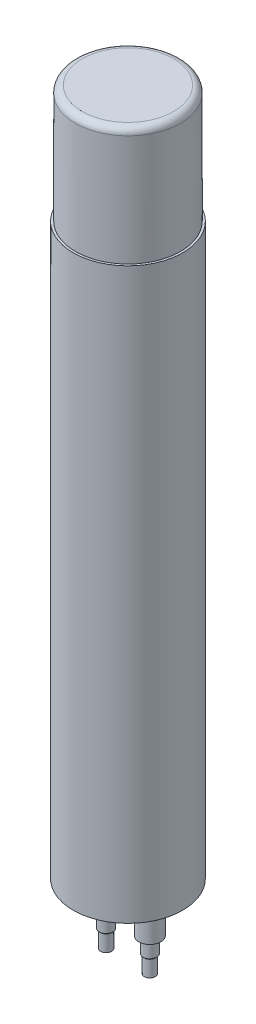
ISO-10303-21;
HEADER;
FILE_DESCRIPTION(('STEP AP214'),'2;1');
FILE_NAME('part.step','',(''),(''),'','','');
FILE_SCHEMA(('AUTOMOTIVE_DESIGN { 1 0 10303 214 1 1 1 1 }'));
ENDSEC;
DATA;
#1=APPLICATION_CONTEXT('core data for automotive mechanical design processes');
#2=APPLICATION_PROTOCOL_DEFINITION('international standard','automotive_design',2000,#1);
#3=PRODUCT_CONTEXT('',#1,'mechanical');
#4=PRODUCT('Part','Part','',(#3));
#5=PRODUCT_RELATED_PRODUCT_CATEGORY('part','',(#4));
#6=PRODUCT_DEFINITION_FORMATION('','',#4);
#7=PRODUCT_DEFINITION_CONTEXT('part definition',#1,'design');
#8=PRODUCT_DEFINITION('design','',#6,#7);
#9=PRODUCT_DEFINITION_SHAPE('','',#8);
#10=(LENGTH_UNIT() NAMED_UNIT(*) SI_UNIT(.MILLI.,.METRE.));
#11=(NAMED_UNIT(*) PLANE_ANGLE_UNIT() SI_UNIT($,.RADIAN.));
#12=(NAMED_UNIT(*) SI_UNIT($,.STERADIAN.) SOLID_ANGLE_UNIT());
#13=UNCERTAINTY_MEASURE_WITH_UNIT(LENGTH_MEASURE(1.E-05),#10,'distance_accuracy_value','');
#14=(GEOMETRIC_REPRESENTATION_CONTEXT(3) GLOBAL_UNCERTAINTY_ASSIGNED_CONTEXT((#13)) GLOBAL_UNIT_ASSIGNED_CONTEXT((#10,
#11,#12)) REPRESENTATION_CONTEXT('',''));
#15=CARTESIAN_POINT('',(0.,0.,0.));
#16=DIRECTION('',(0.,0.,1.));
#17=DIRECTION('',(1.,0.,0.));
#18=AXIS2_PLACEMENT_3D('',#15,#16,#17);
#19=CARTESIAN_POINT('',(63.5000000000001,-797.052,0.));
#20=DIRECTION('',(0.,1.,0.));
#21=DIRECTION('',(-1.,0.,0.));
#22=AXIS2_PLACEMENT_3D('',#19,#20,#21);
#23=PLANE('',#22);
#24=CARTESIAN_POINT('',(-25.4000000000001,-797.052,0.));
#25=DIRECTION('',(0.,1.,0.));
#26=DIRECTION('',(-1.,0.,0.));
#27=AXIS2_PLACEMENT_3D('',#24,#25,#26);
#28=CIRCLE('',#27,12.7);
#29=CARTESIAN_POINT('',(-38.1000000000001,-797.052,0.));
#30=VERTEX_POINT('',#29);
#31=EDGE_CURVE('E78',#30,#30,#28,.T.);
#32=ORIENTED_EDGE('',*,*,#31,.T.);
#33=EDGE_LOOP('',(#32));
#34=FACE_BOUND('',#33,.T.);
#35=CARTESIAN_POINT('',(0.,-797.052,0.));
#36=DIRECTION('',(0.,1.,0.));
#37=DIRECTION('',(-1.,0.,0.));
#38=AXIS2_PLACEMENT_3D('',#35,#36,#37);
#39=CIRCLE('',#38,63.5);
#40=CARTESIAN_POINT('',(-63.4999999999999,-797.052,0.));
#41=VERTEX_POINT('',#40);
#42=EDGE_CURVE('E54',#41,#41,#39,.T.);
#43=ORIENTED_EDGE('',*,*,#42,.F.);
#44=EDGE_LOOP('',(#43));
#45=FACE_BOUND('',#44,.T.);
#46=CARTESIAN_POINT('',(25.4000000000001,-797.052,0.));
#47=DIRECTION('',(0.,1.,0.));
#48=DIRECTION('',(-1.,0.,0.));
#49=AXIS2_PLACEMENT_3D('',#46,#47,#48);
#50=CIRCLE('',#49,12.7);
#51=CARTESIAN_POINT('',(12.7000000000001,-797.052,0.));
#52=VERTEX_POINT('',#51);
#53=EDGE_CURVE('E42',#52,#52,#50,.F.);
#54=ORIENTED_EDGE('',*,*,#53,.F.);
#55=EDGE_LOOP('',(#54));
#56=FACE_BOUND('',#55,.T.);
#57=ADVANCED_FACE('F32',(#34,#45,#56),#23,.F.);
#58=CARTESIAN_POINT('',(0.,0.,0.));
#59=DIRECTION('',(0.,1.,0.));
#60=DIRECTION('',(-1.,0.,0.));
#61=AXIS2_PLACEMENT_3D('',#58,#59,#60);
#62=CYLINDRICAL_SURFACE('',#61,63.5);
#63=CARTESIAN_POINT('',(0.,-136.652,0.));
#64=DIRECTION('',(0.,1.,0.));
#65=DIRECTION('',(-1.,0.,0.));
#66=AXIS2_PLACEMENT_3D('',#63,#64,#65);
#67=CIRCLE('',#66,63.5);
#68=CARTESIAN_POINT('',(-63.5,-136.652,0.));
#69=VERTEX_POINT('',#68);
#70=EDGE_CURVE('E57',#69,#69,#67,.T.);
#71=ORIENTED_EDGE('',*,*,#70,.F.);
#72=EDGE_LOOP('',(#71));
#73=FACE_BOUND('',#72,.T.);
#74=ORIENTED_EDGE('',*,*,#42,.T.);
#75=EDGE_LOOP('',(#74));
#76=FACE_BOUND('',#75,.T.);
#77=ADVANCED_FACE('F116',(#73,#76),#62,.T.);
#78=CARTESIAN_POINT('',(60.96,-136.652,0.));
#79=DIRECTION('',(0.,-1.,0.));
#80=DIRECTION('',(1.,0.,0.));
#81=AXIS2_PLACEMENT_3D('',#78,#79,#80);
#82=PLANE('',#81);
#83=CARTESIAN_POINT('',(0.,-136.652,0.));
#84=DIRECTION('',(0.,1.,0.));
#85=DIRECTION('',(-1.,0.,0.));
#86=AXIS2_PLACEMENT_3D('',#83,#84,#85);
#87=CIRCLE('',#86,60.96);
#88=CARTESIAN_POINT('',(-60.96,-136.652,0.));
#89=VERTEX_POINT('',#88);
#90=EDGE_CURVE('E60',#89,#89,#87,.T.);
#91=ORIENTED_EDGE('',*,*,#90,.F.);
#92=EDGE_LOOP('',(#91));
#93=FACE_BOUND('',#92,.T.);
#94=ORIENTED_EDGE('',*,*,#70,.T.);
#95=EDGE_LOOP('',(#94));
#96=FACE_BOUND('',#95,.T.);
#97=ADVANCED_FACE('F121',(#93,#96),#82,.F.);
#98=CARTESIAN_POINT('',(0.,0.,0.));
#99=DIRECTION('',(0.,1.,0.));
#100=DIRECTION('',(-1.,0.,0.));
#101=AXIS2_PLACEMENT_3D('',#98,#99,#100);
#102=CYLINDRICAL_SURFACE('',#101,60.96);
#103=CARTESIAN_POINT('',(0.,-7.9248,0.));
#104=DIRECTION('',(0.,-1.,0.));
#105=DIRECTION('',(1.,0.,0.));
#106=AXIS2_PLACEMENT_3D('',#103,#104,#105);
#107=CIRCLE('',#106,60.96);
#108=CARTESIAN_POINT('',(60.96,-7.9248,0.));
#109=VERTEX_POINT('',#108);
#110=EDGE_CURVE('E46',#109,#109,#107,.T.);
#111=ORIENTED_EDGE('',*,*,#110,.T.);
#112=EDGE_LOOP('',(#111));
#113=FACE_BOUND('',#112,.T.);
#114=ORIENTED_EDGE('',*,*,#90,.T.);
#115=EDGE_LOOP('',(#114));
#116=FACE_BOUND('',#115,.T.);
#117=ADVANCED_FACE('F150',(#113,#116),#102,.T.);
#118=CARTESIAN_POINT('',(0.,0.,0.));
#119=DIRECTION('',(0.,-1.,0.));
#120=DIRECTION('',(1.,0.,0.));
#121=AXIS2_PLACEMENT_3D('',#118,#119,#120);
#122=PLANE('',#121);
#123=CARTESIAN_POINT('',(0.,0.,0.));
#124=DIRECTION('',(0.,-1.,0.));
#125=DIRECTION('',(1.,0.,0.));
#126=AXIS2_PLACEMENT_3D('',#123,#124,#125);
#127=CIRCLE('',#126,53.0352);
#128=CARTESIAN_POINT('',(53.0352,0.,0.));
#129=VERTEX_POINT('',#128);
#130=EDGE_CURVE('E51',#129,#129,#127,.F.);
#131=ORIENTED_EDGE('',*,*,#130,.T.);
#132=EDGE_LOOP('',(#131));
#133=FACE_BOUND('',#132,.T.);
#134=ADVANCED_FACE('F142',(#133),#122,.F.);
#135=CARTESIAN_POINT('',(0.,-7.9248,0.));
#136=DIRECTION('',(0.,-1.,0.));
#137=DIRECTION('',(1.,0.,0.));
#138=AXIS2_PLACEMENT_3D('',#135,#136,#137);
#139=TOROIDAL_SURFACE('',#138,53.0352,7.9248);
#140=ORIENTED_EDGE('',*,*,#110,.F.);
#141=EDGE_LOOP('',(#140));
#142=FACE_BOUND('',#141,.T.);
#143=ORIENTED_EDGE('',*,*,#130,.F.);
#144=EDGE_LOOP('',(#143));
#145=FACE_BOUND('',#144,.T.);
#146=ADVANCED_FACE('F132',(#142,#145),#139,.T.);
#147=CARTESIAN_POINT('',(25.4000000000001,-841.502,0.));
#148=DIRECTION('',(0.,1.,0.));
#149=DIRECTION('',(-1.,0.,0.));
#150=AXIS2_PLACEMENT_3D('',#147,#148,#149);
#151=CYLINDRICAL_SURFACE('',#150,12.7);
#152=CARTESIAN_POINT('',(25.4000000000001,-841.502,0.));
#153=DIRECTION('',(0.,-1.,0.));
#154=DIRECTION('',(1.,0.,0.));
#155=AXIS2_PLACEMENT_3D('',#152,#153,#154);
#156=CIRCLE('',#155,12.7);
#157=CARTESIAN_POINT('',(38.1000000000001,-841.502,0.));
#158=VERTEX_POINT('',#157);
#159=EDGE_CURVE('E63',#158,#158,#156,.T.);
#160=ORIENTED_EDGE('',*,*,#159,.F.);
#161=EDGE_LOOP('',(#160));
#162=FACE_BOUND('',#161,.T.);
#163=ORIENTED_EDGE('',*,*,#53,.T.);
#164=EDGE_LOOP('',(#163));
#165=FACE_BOUND('',#164,.T.);
#166=ADVANCED_FACE('F129',(#162,#165),#151,.T.);
#167=CARTESIAN_POINT('',(25.4000000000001,-841.502,0.));
#168=DIRECTION('',(0.,-1.,0.));
#169=DIRECTION('',(1.,0.,0.));
#170=AXIS2_PLACEMENT_3D('',#167,#168,#169);
#171=PLANE('',#170);
#172=CARTESIAN_POINT('',(25.4000000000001,-841.502,0.));
#173=DIRECTION('',(0.,-1.,0.));
#174=DIRECTION('',(1.,0.,0.));
#175=AXIS2_PLACEMENT_3D('',#172,#173,#174);
#176=CIRCLE('',#175,7.8797643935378);
#177=CARTESIAN_POINT('',(33.2797643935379,-841.502,0.));
#178=VERTEX_POINT('',#177);
#179=EDGE_CURVE('E38',#178,#178,#176,.T.);
#180=ORIENTED_EDGE('',*,*,#179,.F.);
#181=EDGE_LOOP('',(#180));
#182=FACE_BOUND('',#181,.T.);
#183=ORIENTED_EDGE('',*,*,#159,.T.);
#184=EDGE_LOOP('',(#183));
#185=FACE_BOUND('',#184,.T.);
#186=ADVANCED_FACE('F131',(#182,#185),#171,.T.);
#187=CARTESIAN_POINT('',(25.4000000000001,-879.602,0.));
#188=DIRECTION('',(0.,-1.,0.));
#189=DIRECTION('',(1.,0.,0.));
#190=AXIS2_PLACEMENT_3D('',#187,#188,#189);
#191=PLANE('',#190);
#192=CARTESIAN_POINT('',(25.4000000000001,-879.602,0.));
#193=DIRECTION('',(0.,-1.,0.));
#194=DIRECTION('',(1.,0.,0.));
#195=AXIS2_PLACEMENT_3D('',#192,#193,#194);
#196=CIRCLE('',#195,6.35);
#197=CARTESIAN_POINT('',(31.7500000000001,-879.602,0.));
#198=VERTEX_POINT('',#197);
#199=EDGE_CURVE('E66',#198,#198,#196,.T.);
#200=ORIENTED_EDGE('',*,*,#199,.T.);
#201=EDGE_LOOP('',(#200));
#202=FACE_BOUND('',#201,.T.);
#203=ADVANCED_FACE('F139',(#202),#191,.T.);
#204=CARTESIAN_POINT('',(25.4000000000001,-841.502,0.));
#205=DIRECTION('',(0.,-1.,0.));
#206=DIRECTION('',(1.,0.,0.));
#207=AXIS2_PLACEMENT_3D('',#204,#205,#206);
#208=CYLINDRICAL_SURFACE('',#207,6.35);
#209=CARTESIAN_POINT('',(25.4000000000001,-860.811764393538,0.));
#210=DIRECTION('',(0.,-1.,0.));
#211=DIRECTION('',(1.,0.,0.));
#212=AXIS2_PLACEMENT_3D('',#209,#210,#211);
#213=CIRCLE('',#212,6.35000000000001);
#214=CARTESIAN_POINT('',(31.7500000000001,-860.811764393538,0.));
#215=VERTEX_POINT('',#214);
#216=EDGE_CURVE('E69',#215,#215,#213,.T.);
#217=ORIENTED_EDGE('',*,*,#216,.T.);
#218=EDGE_LOOP('',(#217));
#219=FACE_BOUND('',#218,.T.);
#220=ORIENTED_EDGE('',*,*,#199,.F.);
#221=EDGE_LOOP('',(#220));
#222=FACE_BOUND('',#221,.T.);
#223=ADVANCED_FACE('F198',(#219,#222),#208,.T.);
#224=CARTESIAN_POINT('',(25.4000000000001,-860.811764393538,0.));
#225=DIRECTION('',(0.,1.,0.));
#226=DIRECTION('',(-1.,0.,0.));
#227=AXIS2_PLACEMENT_3D('',#224,#225,#226);
#228=CONICAL_SURFACE('',#227,6.35,0.785398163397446);
#229=CARTESIAN_POINT('',(25.4000000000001,-859.282,0.));
#230=DIRECTION('',(0.,-1.,0.));
#231=DIRECTION('',(1.,0.,0.));
#232=AXIS2_PLACEMENT_3D('',#229,#230,#231);
#233=CIRCLE('',#232,7.8797643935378);
#234=CARTESIAN_POINT('',(33.2797643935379,-859.282,0.));
#235=VERTEX_POINT('',#234);
#236=EDGE_CURVE('E72',#235,#235,#233,.T.);
#237=ORIENTED_EDGE('',*,*,#236,.T.);
#238=EDGE_LOOP('',(#237));
#239=FACE_BOUND('',#238,.T.);
#240=ORIENTED_EDGE('',*,*,#216,.F.);
#241=EDGE_LOOP('',(#240));
#242=FACE_BOUND('',#241,.T.);
#243=ADVANCED_FACE('F207',(#239,#242),#228,.T.);
#244=CARTESIAN_POINT('',(25.4000000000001,-841.502,0.));
#245=DIRECTION('',(0.,-1.,0.));
#246=DIRECTION('',(1.,0.,0.));
#247=AXIS2_PLACEMENT_3D('',#244,#245,#246);
#248=CYLINDRICAL_SURFACE('',#247,7.8797643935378);
#249=ORIENTED_EDGE('',*,*,#179,.T.);
#250=EDGE_LOOP('',(#249));
#251=FACE_BOUND('',#250,.T.);
#252=ORIENTED_EDGE('',*,*,#236,.F.);
#253=EDGE_LOOP('',(#252));
#254=FACE_BOUND('',#253,.T.);
#255=ADVANCED_FACE('F217',(#251,#254),#248,.T.);
#256=CARTESIAN_POINT('',(-25.4000000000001,-841.502,0.));
#257=DIRECTION('',(0.,1.,0.));
#258=DIRECTION('',(-1.,0.,0.));
#259=AXIS2_PLACEMENT_3D('',#256,#257,#258);
#260=CYLINDRICAL_SURFACE('',#259,12.7);
#261=CARTESIAN_POINT('',(-25.4000000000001,-841.502,0.));
#262=DIRECTION('',(0.,1.,0.));
#263=DIRECTION('',(-1.,0.,0.));
#264=AXIS2_PLACEMENT_3D('',#261,#262,#263);
#265=CIRCLE('',#264,12.7);
#266=CARTESIAN_POINT('',(-38.1000000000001,-841.502,0.));
#267=VERTEX_POINT('',#266);
#268=EDGE_CURVE('E75',#267,#267,#265,.T.);
#269=ORIENTED_EDGE('',*,*,#268,.T.);
#270=EDGE_LOOP('',(#269));
#271=FACE_BOUND('',#270,.T.);
#272=ORIENTED_EDGE('',*,*,#31,.F.);
#273=EDGE_LOOP('',(#272));
#274=FACE_BOUND('',#273,.T.);
#275=ADVANCED_FACE('F112',(#271,#274),#260,.T.);
#276=CARTESIAN_POINT('',(-25.4000000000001,-841.502,0.));
#277=DIRECTION('',(0.,-1.,0.));
#278=DIRECTION('',(-1.,0.,0.));
#279=AXIS2_PLACEMENT_3D('',#276,#277,#278);
#280=PLANE('',#279);
#281=CARTESIAN_POINT('',(-25.4000000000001,-841.502,0.));
#282=DIRECTION('',(0.,-1.,0.));
#283=DIRECTION('',(1.,0.,0.));
#284=AXIS2_PLACEMENT_3D('',#281,#282,#283);
#285=CIRCLE('',#284,7.8797643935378);
#286=CARTESIAN_POINT('',(-17.5202356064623,-841.502,0.));
#287=VERTEX_POINT('',#286);
#288=EDGE_CURVE('E10',#287,#287,#285,.T.);
#289=ORIENTED_EDGE('',*,*,#288,.F.);
#290=EDGE_LOOP('',(#289));
#291=FACE_BOUND('',#290,.T.);
#292=ORIENTED_EDGE('',*,*,#268,.F.);
#293=EDGE_LOOP('',(#292));
#294=FACE_BOUND('',#293,.T.);
#295=ADVANCED_FACE('F107',(#291,#294),#280,.T.);
#296=CARTESIAN_POINT('',(-25.4000000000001,-879.602,0.));
#297=DIRECTION('',(0.,-1.,0.));
#298=DIRECTION('',(-1.,0.,0.));
#299=AXIS2_PLACEMENT_3D('',#296,#297,#298);
#300=PLANE('',#299);
#301=CARTESIAN_POINT('',(-25.4000000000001,-879.602,0.));
#302=DIRECTION('',(0.,1.,0.));
#303=DIRECTION('',(-1.,0.,0.));
#304=AXIS2_PLACEMENT_3D('',#301,#302,#303);
#305=CIRCLE('',#304,6.35);
#306=CARTESIAN_POINT('',(-31.7500000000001,-879.602,0.));
#307=VERTEX_POINT('',#306);
#308=EDGE_CURVE('E81',#307,#307,#305,.T.);
#309=ORIENTED_EDGE('',*,*,#308,.F.);
#310=EDGE_LOOP('',(#309));
#311=FACE_BOUND('',#310,.T.);
#312=ADVANCED_FACE('F102',(#311),#300,.T.);
#313=CARTESIAN_POINT('',(-25.4000000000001,-841.502,0.));
#314=DIRECTION('',(0.,-1.,0.));
#315=DIRECTION('',(-1.,0.,0.));
#316=AXIS2_PLACEMENT_3D('',#313,#314,#315);
#317=CYLINDRICAL_SURFACE('',#316,6.35);
#318=CARTESIAN_POINT('',(-25.4000000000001,-860.811764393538,0.));
#319=DIRECTION('',(0.,1.,0.));
#320=DIRECTION('',(-1.,0.,0.));
#321=AXIS2_PLACEMENT_3D('',#318,#319,#320);
#322=CIRCLE('',#321,6.35000000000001);
#323=CARTESIAN_POINT('',(-31.7500000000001,-860.811764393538,0.));
#324=VERTEX_POINT('',#323);
#325=EDGE_CURVE('E84',#324,#324,#322,.T.);
#326=ORIENTED_EDGE('',*,*,#325,.F.);
#327=EDGE_LOOP('',(#326));
#328=FACE_BOUND('',#327,.T.);
#329=ORIENTED_EDGE('',*,*,#308,.T.);
#330=EDGE_LOOP('',(#329));
#331=FACE_BOUND('',#330,.T.);
#332=ADVANCED_FACE('F96',(#328,#331),#317,.T.);
#333=CARTESIAN_POINT('',(-25.4000000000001,-860.811764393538,0.));
#334=DIRECTION('',(0.,1.,0.));
#335=DIRECTION('',(1.,0.,0.));
#336=AXIS2_PLACEMENT_3D('',#333,#334,#335);
#337=CONICAL_SURFACE('',#336,6.35,0.785398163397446);
#338=CARTESIAN_POINT('',(-25.4000000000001,-859.282,0.));
#339=DIRECTION('',(0.,1.,0.));
#340=DIRECTION('',(-1.,0.,0.));
#341=AXIS2_PLACEMENT_3D('',#338,#339,#340);
#342=CIRCLE('',#341,7.8797643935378);
#343=CARTESIAN_POINT('',(-33.2797643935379,-859.282,0.));
#344=VERTEX_POINT('',#343);
#345=EDGE_CURVE('E87',#344,#344,#342,.T.);
#346=ORIENTED_EDGE('',*,*,#345,.F.);
#347=EDGE_LOOP('',(#346));
#348=FACE_BOUND('',#347,.T.);
#349=ORIENTED_EDGE('',*,*,#325,.T.);
#350=EDGE_LOOP('',(#349));
#351=FACE_BOUND('',#350,.T.);
#352=ADVANCED_FACE('F93',(#348,#351),#337,.T.);
#353=CARTESIAN_POINT('',(-25.4000000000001,-841.502,0.));
#354=DIRECTION('',(0.,-1.,0.));
#355=DIRECTION('',(-1.,0.,0.));
#356=AXIS2_PLACEMENT_3D('',#353,#354,#355);
#357=CYLINDRICAL_SURFACE('',#356,7.8797643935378);
#358=ORIENTED_EDGE('',*,*,#288,.T.);
#359=EDGE_LOOP('',(#358));
#360=FACE_BOUND('',#359,.T.);
#361=ORIENTED_EDGE('',*,*,#345,.T.);
#362=EDGE_LOOP('',(#361));
#363=FACE_BOUND('',#362,.T.);
#364=ADVANCED_FACE('F91',(#360,#363),#357,.T.);
#365=CLOSED_SHELL('',(#57,#77,#97,#117,#134,#146,#166,#186,#203,#223,#243,#255,#275,#295,#312,
#332,#352,#364));
#366=MANIFOLD_SOLID_BREP('B2',#365);
#367=ADVANCED_BREP_SHAPE_REPRESENTATION('',(#18,#366),#14);
#368=SHAPE_DEFINITION_REPRESENTATION(#9,#367);
ENDSEC;
END-ISO-10303-21;
